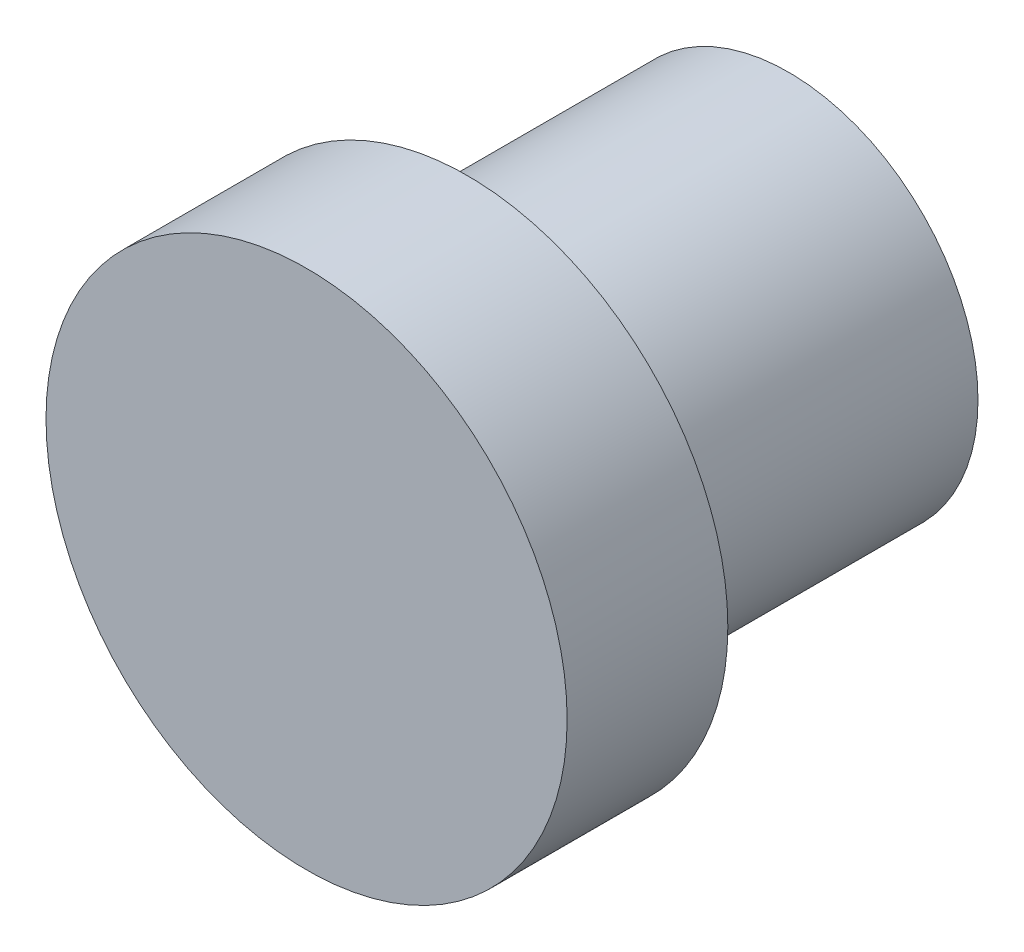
ISO-10303-21;
HEADER;
FILE_DESCRIPTION(('STEP AP214'),'2;1');
FILE_NAME('part.step','',(''),(''),'','','');
FILE_SCHEMA(('AUTOMOTIVE_DESIGN { 1 0 10303 214 1 1 1 1 }'));
ENDSEC;
DATA;
#1=APPLICATION_CONTEXT('core data for automotive mechanical design processes');
#2=APPLICATION_PROTOCOL_DEFINITION('international standard','automotive_design',2000,#1);
#3=PRODUCT_CONTEXT('',#1,'mechanical');
#4=PRODUCT('Part','Part','',(#3));
#5=PRODUCT_RELATED_PRODUCT_CATEGORY('part','',(#4));
#6=PRODUCT_DEFINITION_FORMATION('','',#4);
#7=PRODUCT_DEFINITION_CONTEXT('part definition',#1,'design');
#8=PRODUCT_DEFINITION('design','',#6,#7);
#9=PRODUCT_DEFINITION_SHAPE('','',#8);
#10=(LENGTH_UNIT() NAMED_UNIT(*) SI_UNIT(.MILLI.,.METRE.));
#11=(NAMED_UNIT(*) PLANE_ANGLE_UNIT() SI_UNIT($,.RADIAN.));
#12=(NAMED_UNIT(*) SI_UNIT($,.STERADIAN.) SOLID_ANGLE_UNIT());
#13=UNCERTAINTY_MEASURE_WITH_UNIT(LENGTH_MEASURE(1.E-05),#10,'distance_accuracy_value','');
#14=(GEOMETRIC_REPRESENTATION_CONTEXT(3) GLOBAL_UNCERTAINTY_ASSIGNED_CONTEXT((#13)) GLOBAL_UNIT_ASSIGNED_CONTEXT((#10,
#11,#12)) REPRESENTATION_CONTEXT('',''));
#15=CARTESIAN_POINT('',(0.,0.,0.));
#16=DIRECTION('',(0.,0.,1.));
#17=DIRECTION('',(1.,0.,0.));
#18=AXIS2_PLACEMENT_3D('',#15,#16,#17);
#19=CARTESIAN_POINT('',(0.,0.,-5.08));
#20=DIRECTION('',(0.,0.,1.));
#21=DIRECTION('',(1.,0.,0.));
#22=AXIS2_PLACEMENT_3D('',#19,#20,#21);
#23=CYLINDRICAL_SURFACE('',#22,2.99251043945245);
#24=CARTESIAN_POINT('',(0.,0.,-5.08));
#25=DIRECTION('',(0.,0.,1.));
#26=DIRECTION('',(1.,0.,0.));
#27=AXIS2_PLACEMENT_3D('',#24,#25,#26);
#28=CIRCLE('',#27,2.99251043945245);
#29=CARTESIAN_POINT('',(2.99251043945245,0.,-5.08));
#30=VERTEX_POINT('',#29);
#31=EDGE_CURVE('E10',#30,#30,#28,.T.);
#32=ORIENTED_EDGE('',*,*,#31,.T.);
#33=EDGE_LOOP('',(#32));
#34=FACE_BOUND('',#33,.T.);
#35=CARTESIAN_POINT('',(0.,0.,0.));
#36=DIRECTION('',(0.,0.,1.));
#37=DIRECTION('',(1.,0.,0.));
#38=AXIS2_PLACEMENT_3D('',#35,#36,#37);
#39=CIRCLE('',#38,2.99251043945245);
#40=CARTESIAN_POINT('',(2.99251043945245,0.,0.));
#41=VERTEX_POINT('',#40);
#42=EDGE_CURVE('E33',#41,#41,#39,.T.);
#43=ORIENTED_EDGE('',*,*,#42,.F.);
#44=EDGE_LOOP('',(#43));
#45=FACE_BOUND('',#44,.T.);
#46=ADVANCED_FACE('F30',(#34,#45),#23,.T.);
#47=CARTESIAN_POINT('',(0.,0.,-5.08));
#48=DIRECTION('',(0.,0.,1.));
#49=DIRECTION('',(1.,0.,0.));
#50=AXIS2_PLACEMENT_3D('',#47,#48,#49);
#51=PLANE('',#50);
#52=ORIENTED_EDGE('',*,*,#31,.F.);
#53=EDGE_LOOP('',(#52));
#54=FACE_BOUND('',#53,.T.);
#55=ADVANCED_FACE('F53',(#54),#51,.F.);
#56=CARTESIAN_POINT('',(0.,0.,2.54));
#57=DIRECTION('',(0.,0.,-1.));
#58=DIRECTION('',(-1.,0.,0.));
#59=AXIS2_PLACEMENT_3D('',#56,#57,#58);
#60=CYLINDRICAL_SURFACE('',#59,4.11854366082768);
#61=CARTESIAN_POINT('',(0.,0.,2.54));
#62=DIRECTION('',(0.,0.,1.));
#63=DIRECTION('',(1.,0.,0.));
#64=AXIS2_PLACEMENT_3D('',#61,#62,#63);
#65=CIRCLE('',#64,4.11854366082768);
#66=CARTESIAN_POINT('',(4.11854366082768,0.,2.54));
#67=VERTEX_POINT('',#66);
#68=EDGE_CURVE('E40',#67,#67,#65,.T.);
#69=ORIENTED_EDGE('',*,*,#68,.F.);
#70=EDGE_LOOP('',(#69));
#71=FACE_BOUND('',#70,.T.);
#72=CARTESIAN_POINT('',(0.,0.,0.));
#73=DIRECTION('',(0.,0.,1.));
#74=DIRECTION('',(1.,0.,0.));
#75=AXIS2_PLACEMENT_3D('',#72,#73,#74);
#76=CIRCLE('',#75,4.11854366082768);
#77=CARTESIAN_POINT('',(4.11854366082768,0.,0.));
#78=VERTEX_POINT('',#77);
#79=EDGE_CURVE('E42',#78,#78,#76,.T.);
#80=ORIENTED_EDGE('',*,*,#79,.T.);
#81=EDGE_LOOP('',(#80));
#82=FACE_BOUND('',#81,.T.);
#83=ADVANCED_FACE('F50',(#71,#82),#60,.T.);
#84=CARTESIAN_POINT('',(0.,0.,2.54));
#85=DIRECTION('',(0.,0.,1.));
#86=DIRECTION('',(1.,0.,0.));
#87=AXIS2_PLACEMENT_3D('',#84,#85,#86);
#88=PLANE('',#87);
#89=ORIENTED_EDGE('',*,*,#68,.T.);
#90=EDGE_LOOP('',(#89));
#91=FACE_BOUND('',#90,.T.);
#92=ADVANCED_FACE('F48',(#91),#88,.T.);
#93=CARTESIAN_POINT('',(0.,0.,0.));
#94=DIRECTION('',(0.,0.,1.));
#95=DIRECTION('',(1.,0.,0.));
#96=AXIS2_PLACEMENT_3D('',#93,#94,#95);
#97=PLANE('',#96);
#98=ORIENTED_EDGE('',*,*,#42,.T.);
#99=EDGE_LOOP('',(#98));
#100=FACE_BOUND('',#99,.T.);
#101=ORIENTED_EDGE('',*,*,#79,.F.);
#102=EDGE_LOOP('',(#101));
#103=FACE_BOUND('',#102,.T.);
#104=ADVANCED_FACE('F57',(#100,#103),#97,.F.);
#105=CLOSED_SHELL('',(#46,#55,#83,#92,#104));
#106=MANIFOLD_SOLID_BREP('B2',#105);
#107=ADVANCED_BREP_SHAPE_REPRESENTATION('',(#18,#106),#14);
#108=SHAPE_DEFINITION_REPRESENTATION(#9,#107);
ENDSEC;
END-ISO-10303-21;
